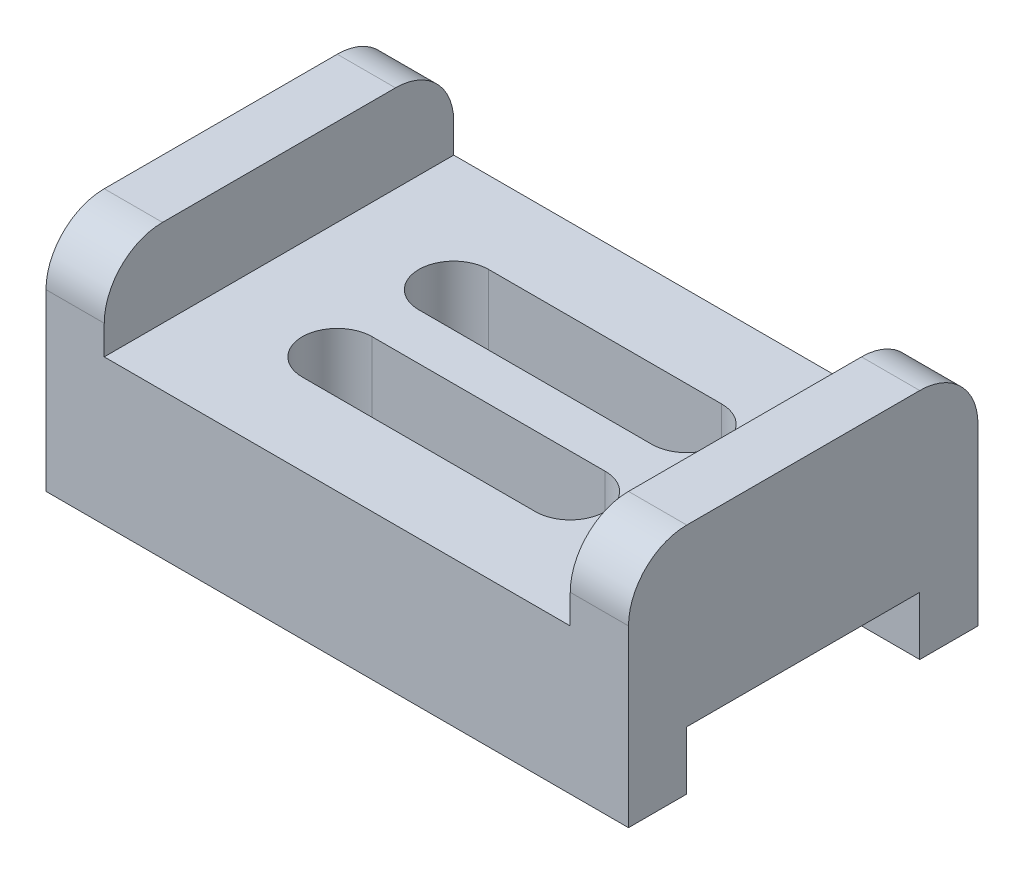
from build123d import *

# Parameters (mm, degrees)
SKETCH_1_W          = 100
SKETCH_1_H          = 60
EXTRUDE_1_DEPTH     = 40
SKETCH_2_W          = 40
SKETCH_2_H          = 10
CUT_EXTRUDE_1_DEPTH = 124.288280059
SKETCH_3_W          = 80
SKETCH_3_H          = 60
CUT_EXTRUDE_2_DEPTH = 15
CUT_EXTRUDE_3_DEPTH = 120.268604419
FILLET_1_R          = 10


with BuildPart() as part:
    # Sketch 1 → Extrude 1 (new body)
    with BuildSketch(Plane(origin=(0, 0, 0), x_dir=(1, 0, 0), z_dir=(0, 1, 0))):
        with Locations((-50, 30)):
            Rectangle(SKETCH_1_W, SKETCH_1_H)
    extrude(amount=EXTRUDE_1_DEPTH)

    # Sketch 2 → Cut-Extrude 1 (cut, through all)
    with BuildSketch(Plane(origin=(0, 0, 0), x_dir=(0, 0, -1), z_dir=(1, 0, 0))):
        with Locations((30, 5)):
            Rectangle(SKETCH_2_W, SKETCH_2_H)
    extrude(amount=-CUT_EXTRUDE_1_DEPTH, mode=Mode.SUBTRACT)

    # Sketch 3 → Cut-Extrude 2 (cut)
    with BuildSketch(Plane(origin=(0, 40, 0), x_dir=(1, 0, 0), z_dir=(0, 1, 0))):
        with Locations((-50, 30)):
            Rectangle(SKETCH_3_W, SKETCH_3_H)
    extrude(amount=-CUT_EXTRUDE_2_DEPTH, mode=Mode.SUBTRACT)

    # Sketch 4 → Cut-Extrude 3 (cut, through all)
    with BuildSketch(Plane(origin=(0, 25, 0), x_dir=(1, 0, 0), z_dir=(0, 1, 0))):
        with BuildLine():
            Line((-70, 46), (-30, 46))
            ThreePointArc((-30, 46), (-24, 40), (-30, 34))
            Line((-30, 34), (-70, 34))
            ThreePointArc((-70, 34), (-76, 40), (-70, 46))
        make_face()
        with BuildLine():
            Line((-70, 26), (-30, 26))
            ThreePointArc((-30, 26), (-24, 20), (-30, 14))
            Line((-30, 14), (-70, 14))
            ThreePointArc((-70, 14), (-76, 20), (-70, 26))
        make_face()
    extrude(amount=-CUT_EXTRUDE_3_DEPTH, mode=Mode.SUBTRACT)

    # Fillet 1
    fillet_1_edges = [part.edges().sort_by_distance(p)[0] for p in [
        (-95, 40, 0),
        (-95, 40, -60),
        (-5, 40, 0),
        (-5, 40, -60),
    ]]
    fillet(fillet_1_edges, radius=FILLET_1_R)


solid = part.part
